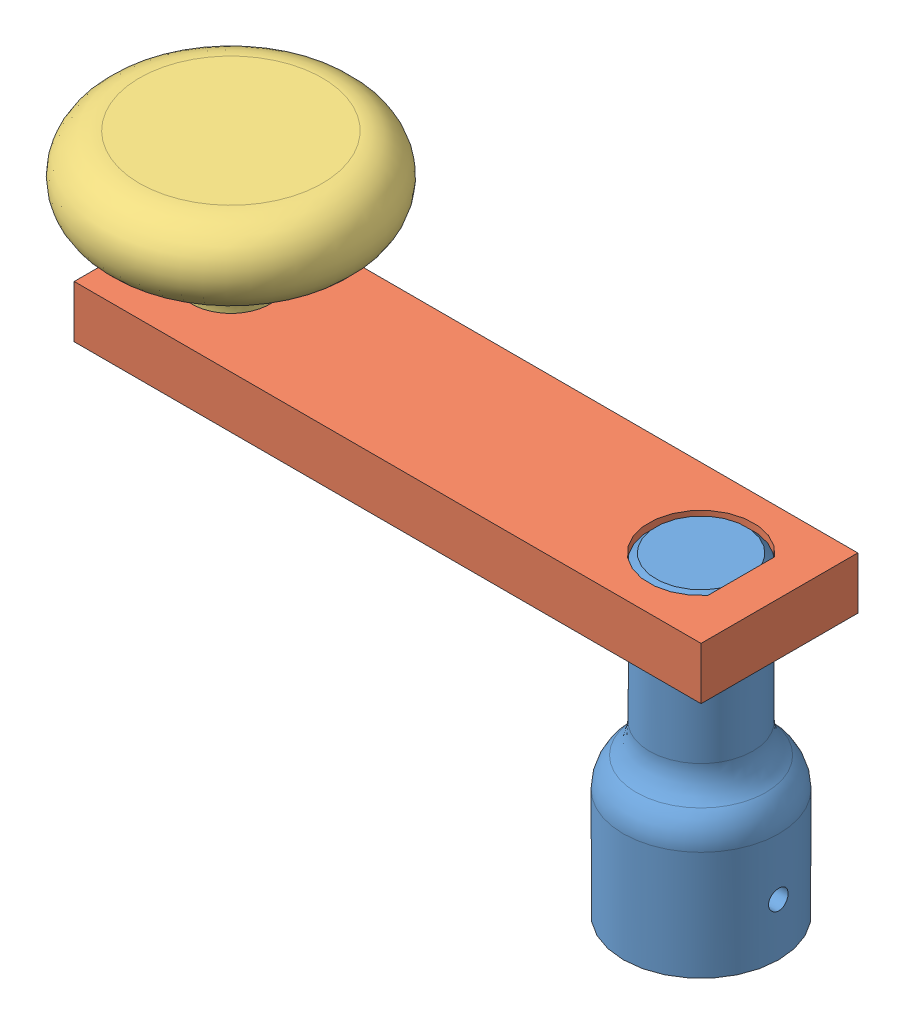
SolidWorks assembly crank sub_&.SLDASM, configuration Default (file format 4100). Lengths in mm.
Overall size (88.68 53.98 44.01).
3 component instances, 3 part files, 5 mates.
Components (placement in the parent):
- crank-shaft_&-1: crank-shaft_&.sldprt [Default] at origin size (18.92 38.1 18.92)
- crank-arm_&-1: crank-arm_&.sldprt [Default] at (-66.675 31.75 -9.525) size (76.2 6.35 19.05)
- crank-knob_&-1: crank-knob_&.sldprt [Default] at (-57.15 31.75 0) x (0.8335 0 0.55252) z (-0.55252 0 0.8335) size (31.75 22.23 31.75)
Mates (geometry in assembly coordinates):
- Concentric1: concentric anti-aligned: cylinder of crank-shaft_&-1 through (0 38.1 0) axis (0 -1 0) radius 6.2865; cylinder of crank-arm_&-1 through (0 31.75 0) axis (0 1 0) radius 6.35
- Parallel1: parallel anti-aligned: plane of crank-shaft_&-1 through (4.8895 31.75 3.9513) normal (1 0 0); plane of crank-arm_&-1 through (4.8895 31.75 -4.0516) normal (-1 0 0)
- Coincident2: coincident: plane of crank-shaft_&-1 through (0 31.75 0) normal (0 1 0); line of crank-arm_&-1 through (9.525 31.75 9.525) axis (0 0 -1)
- Concentric2: concentric anti-aligned: cylinder of crank-arm_&-1 through (-57.15 31.75 0) axis (0 1 0) radius 2.3813; cylinder of crank-knob_&-1 through (-57.15 31.75 0) axis (0 -1 0) radius 2.286
- Coincident3: coincident anti-aligned: plane of crank-arm_&-1 through (9.525 38.1 9.525) normal (0 1 0); plane of crank-knob_&-1 through (-53.1805 38.1 2.6314) normal (0 -1 0)
